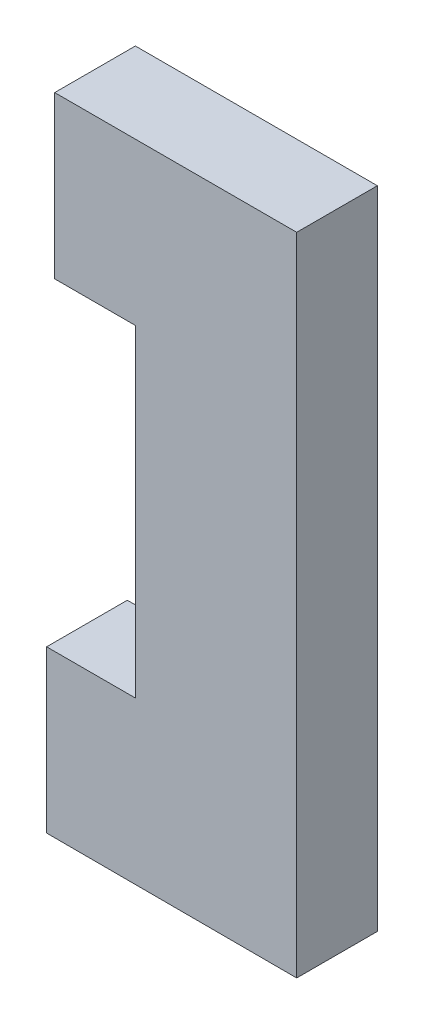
from build123d import *

# Parameters (mm, degrees)
EXTRUDE1_DEPTH = 10


with BuildPart() as part:
    # Sketch1 → Extrude1 (new body)
    with BuildSketch(Plane.XY):
        Polygon((17.021696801, 27.733936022), (47.021696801, 27.733936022), (47.021696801, -52.322844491), (16.021696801, -52.266063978), (16.021696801, -32.266063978), (27.021696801, -32.266063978), (27.021696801, 7.733936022), (17.021696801, 7.733936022), align=None)
    extrude(amount=-EXTRUDE1_DEPTH)


solid = part.part
